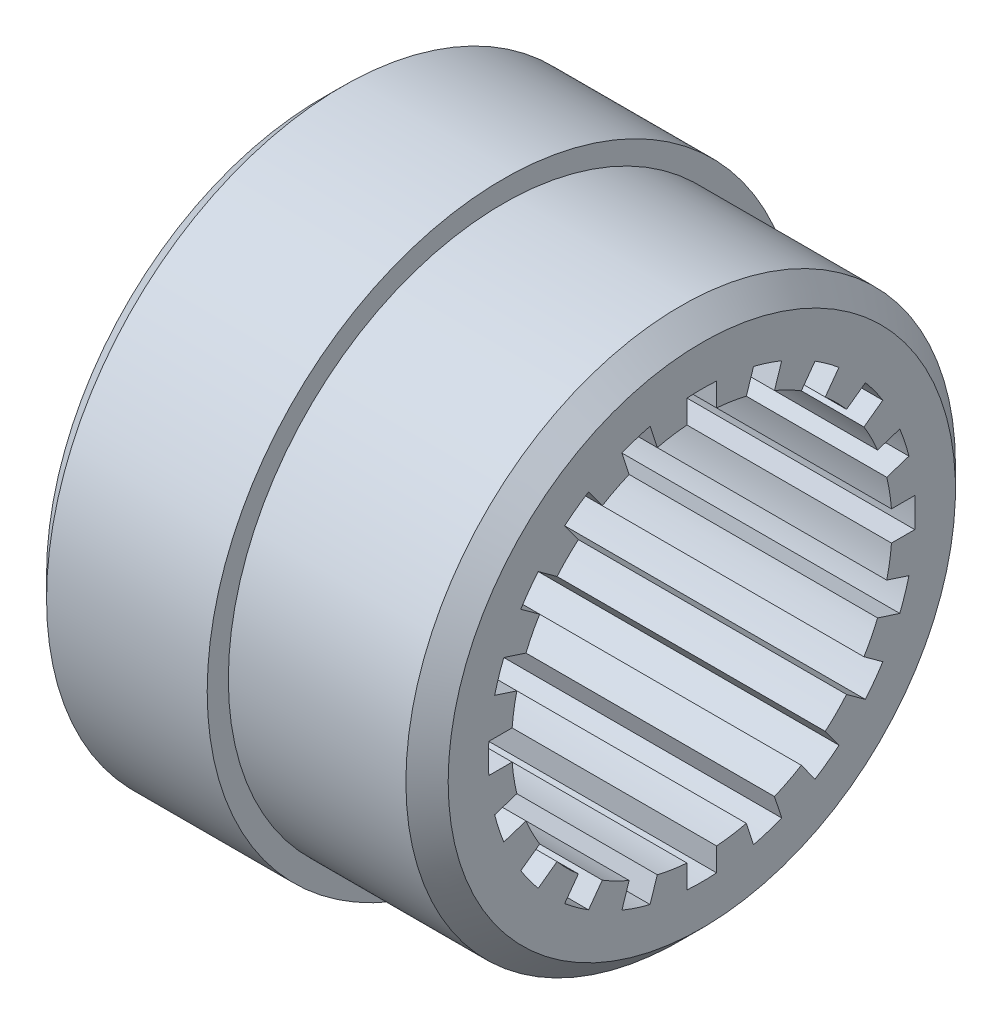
from build123d import *

# Parameters (mm, degrees)
CHANFREIN1_SIZE         = 5
ENL_V_MAT_EXTRU_2_DEPTH = 134.790881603


with BuildPart() as part:
    # Esquisse1 → R_volution1 (revolve)
    with BuildSketch(Plane.XY, mode=Mode.PRIVATE) as r_volution1_sk:
        Polygon((0, 70), (0, 45), (90, 45), (90, 65), (43, 65), (43, 70), align=None)
    revolve(r_volution1_sk.sketch.rotate(Axis((0, 0, 0), (1, 0, 0)), 90), axis=Axis((0, 0, 0), (1, 0, 0)))

    # Chanfrein1
    chanfrein1_edges = [part.edges().sort_by_distance(p)[0] for p in [
        (0, 0, -70),
        (90, 0, -65),
    ]]
    chamfer(chanfrein1_edges, length=CHANFREIN1_SIZE)

    # Esquisse3 → Enl_v. mat.-Extru.2 (cut, through all)
    with BuildSketch(Plane.ZY):
        with BuildLine():
            Line((12.239135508, 48.994423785), (9.404278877, 40.269632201))
            Line((9.404278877, 40.269632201), (16.061674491, 38.10651324))
            Line((16.061674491, 38.10651324), (18.896531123, 46.831304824))
            ThreePointArc((18.896531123, 46.831304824), (15.605358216, 48.028354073), (12.239135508, 48.994423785))
        make_face()
        with BuildLine():
            Line((-3.5, 50.378566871), (-3.5, 41.204778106))
            Line((-3.5, 41.204778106), (3.5, 41.204778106))
            Line((3.5, 41.204778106), (3.5, 50.378566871))
            ThreePointArc((3.5, 50.378566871), (0, 50.5), (-3.5, 50.378566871))
        make_face()
        with BuildLine():
            Line((26.780219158, 42.814365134), (21.388001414, 35.39261412))
            Line((21.388001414, 35.39261412), (27.051120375, 31.278117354))
            Line((27.051120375, 31.278117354), (32.443338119, 38.699868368))
            ThreePointArc((32.443338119, 38.699868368), (29.683155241, 40.855358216), (26.780219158, 42.814365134))
        make_face()
        with BuildLine():
            Line((38.699868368, 32.443338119), (31.278117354, 27.051120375))
            Line((31.278117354, 27.051120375), (35.39261412, 21.388001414))
            Line((35.39261412, 21.388001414), (42.814365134, 26.780219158))
            ThreePointArc((42.814365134, 26.780219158), (40.855358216, 29.683155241), (38.699868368, 32.443338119))
        make_face()
        with BuildLine():
            Line((46.831304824, 18.896531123), (38.10651324, 16.061674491))
            Line((38.10651324, 16.061674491), (40.269632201, 9.404278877))
            Line((40.269632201, 9.404278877), (48.994423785, 12.239135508))
            ThreePointArc((48.994423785, 12.239135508), (48.028354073, 15.605358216), (46.831304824, 18.896531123))
        make_face()
        with BuildLine():
            Line((50.378566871, 3.5), (41.204778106, 3.5))
            Line((41.204778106, 3.5), (41.204778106, -3.5))
            Line((41.204778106, -3.5), (50.378566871, -3.5))
            ThreePointArc((50.378566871, -3.5), (50.5, 0), (50.378566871, 3.5))
        make_face()
        with BuildLine():
            Line((48.994423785, -12.239135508), (40.269632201, -9.404278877))
            Line((40.269632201, -9.404278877), (38.10651324, -16.061674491))
            Line((38.10651324, -16.061674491), (46.831304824, -18.896531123))
            ThreePointArc((46.831304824, -18.896531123), (48.028354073, -15.605358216), (48.994423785, -12.239135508))
        make_face()
        with BuildLine():
            Line((42.814365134, -26.780219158), (35.39261412, -21.388001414))
            Line((35.39261412, -21.388001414), (31.278117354, -27.051120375))
            Line((31.278117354, -27.051120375), (38.699868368, -32.443338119))
            ThreePointArc((38.699868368, -32.443338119), (40.855358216, -29.683155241), (42.814365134, -26.780219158))
        make_face()
        with BuildLine():
            Line((32.443338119, -38.699868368), (27.051120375, -31.278117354))
            Line((27.051120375, -31.278117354), (21.388001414, -35.39261412))
            Line((21.388001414, -35.39261412), (26.780219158, -42.814365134))
            ThreePointArc((26.780219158, -42.814365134), (29.683155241, -40.855358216), (32.443338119, -38.699868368))
        make_face()
        with BuildLine():
            Line((18.896531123, -46.831304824), (16.061674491, -38.10651324))
            Line((16.061674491, -38.10651324), (9.404278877, -40.269632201))
            Line((9.404278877, -40.269632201), (12.239135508, -48.994423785))
            ThreePointArc((12.239135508, -48.994423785), (15.605358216, -48.028354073), (18.896531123, -46.831304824))
        make_face()
        with BuildLine():
            Line((3.5, -50.378566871), (3.5, -41.204778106))
            Line((3.5, -41.204778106), (-3.5, -41.204778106))
            Line((-3.5, -41.204778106), (-3.5, -50.378566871))
            ThreePointArc((-3.5, -50.378566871), (0, -50.5), (3.5, -50.378566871))
        make_face()
        with BuildLine():
            Line((-12.239135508, -48.994423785), (-9.404278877, -40.269632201))
            Line((-9.404278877, -40.269632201), (-16.061674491, -38.10651324))
            Line((-16.061674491, -38.10651324), (-18.896531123, -46.831304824))
            ThreePointArc((-18.896531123, -46.831304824), (-15.605358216, -48.028354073), (-12.239135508, -48.994423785))
        make_face()
        with BuildLine():
            Line((-26.780219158, -42.814365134), (-21.388001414, -35.39261412))
            Line((-21.388001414, -35.39261412), (-27.051120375, -31.278117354))
            Line((-27.051120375, -31.278117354), (-32.443338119, -38.699868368))
            ThreePointArc((-32.443338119, -38.699868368), (-29.683155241, -40.855358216), (-26.780219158, -42.814365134))
        make_face()
        with BuildLine():
            Line((-38.699868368, -32.443338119), (-31.278117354, -27.051120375))
            Line((-31.278117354, -27.051120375), (-35.39261412, -21.388001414))
            Line((-35.39261412, -21.388001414), (-42.814365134, -26.780219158))
            ThreePointArc((-42.814365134, -26.780219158), (-40.855358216, -29.683155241), (-38.699868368, -32.443338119))
        make_face()
        with BuildLine():
            Line((-46.831304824, -18.896531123), (-38.10651324, -16.061674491))
            Line((-38.10651324, -16.061674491), (-40.269632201, -9.404278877))
            Line((-40.269632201, -9.404278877), (-48.994423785, -12.239135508))
            ThreePointArc((-48.994423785, -12.239135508), (-48.028354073, -15.605358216), (-46.831304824, -18.896531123))
        make_face()
        with BuildLine():
            Line((-50.378566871, -3.5), (-41.204778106, -3.5))
            Line((-41.204778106, -3.5), (-41.204778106, 3.5))
            Line((-41.204778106, 3.5), (-50.378566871, 3.5))
            ThreePointArc((-50.378566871, 3.5), (-50.5, 0), (-50.378566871, -3.5))
        make_face()
        with BuildLine():
            Line((-48.994423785, 12.239135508), (-40.269632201, 9.404278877))
            Line((-40.269632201, 9.404278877), (-38.10651324, 16.061674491))
            Line((-38.10651324, 16.061674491), (-46.831304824, 18.896531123))
            ThreePointArc((-46.831304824, 18.896531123), (-48.028354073, 15.605358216), (-48.994423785, 12.239135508))
        make_face()
        with BuildLine():
            Line((-42.814365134, 26.780219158), (-35.39261412, 21.388001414))
            Line((-35.39261412, 21.388001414), (-31.278117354, 27.051120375))
            Line((-31.278117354, 27.051120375), (-38.699868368, 32.443338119))
            ThreePointArc((-38.699868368, 32.443338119), (-40.855358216, 29.683155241), (-42.814365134, 26.780219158))
        make_face()
        with BuildLine():
            Line((-32.443338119, 38.699868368), (-27.051120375, 31.278117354))
            Line((-27.051120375, 31.278117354), (-21.388001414, 35.39261412))
            Line((-21.388001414, 35.39261412), (-26.780219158, 42.814365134))
            ThreePointArc((-26.780219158, 42.814365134), (-29.683155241, 40.855358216), (-32.443338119, 38.699868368))
        make_face()
        with BuildLine():
            Line((-18.896531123, 46.831304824), (-16.061674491, 38.10651324))
            Line((-16.061674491, 38.10651324), (-9.404278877, 40.269632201))
            Line((-9.404278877, 40.269632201), (-12.239135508, 48.994423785))
            ThreePointArc((-12.239135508, 48.994423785), (-15.605358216, 48.028354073), (-18.896531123, 46.831304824))
        make_face()
    extrude(amount=-ENL_V_MAT_EXTRU_2_DEPTH, mode=Mode.SUBTRACT)


solid = part.part
